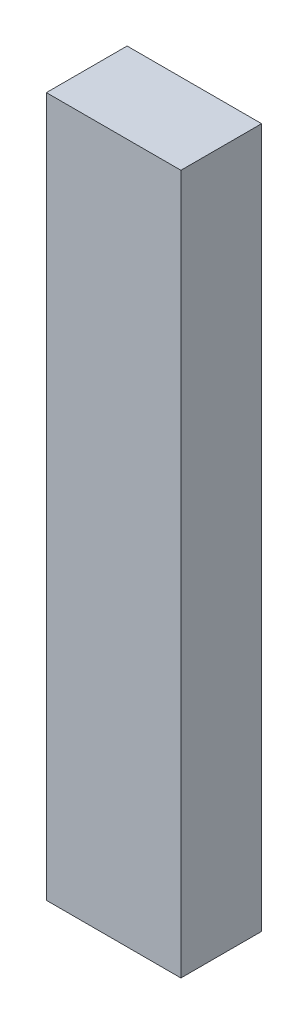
from build123d import *

# Parameters (mm, degrees)
SKETCH1_W            = 330.2
SKETCH1_H            = 38.1
PANEL_OR_BLOCK_DEPTH = 63.5


with BuildPart() as part:
    # Sketch1 → Panel_or_block (new body)
    with BuildSketch(Plane.YZ):
        with Locations((0, 19.05)):
            Rectangle(SKETCH1_W, SKETCH1_H)
    extrude(amount=PANEL_OR_BLOCK_DEPTH)


solid = part.part
